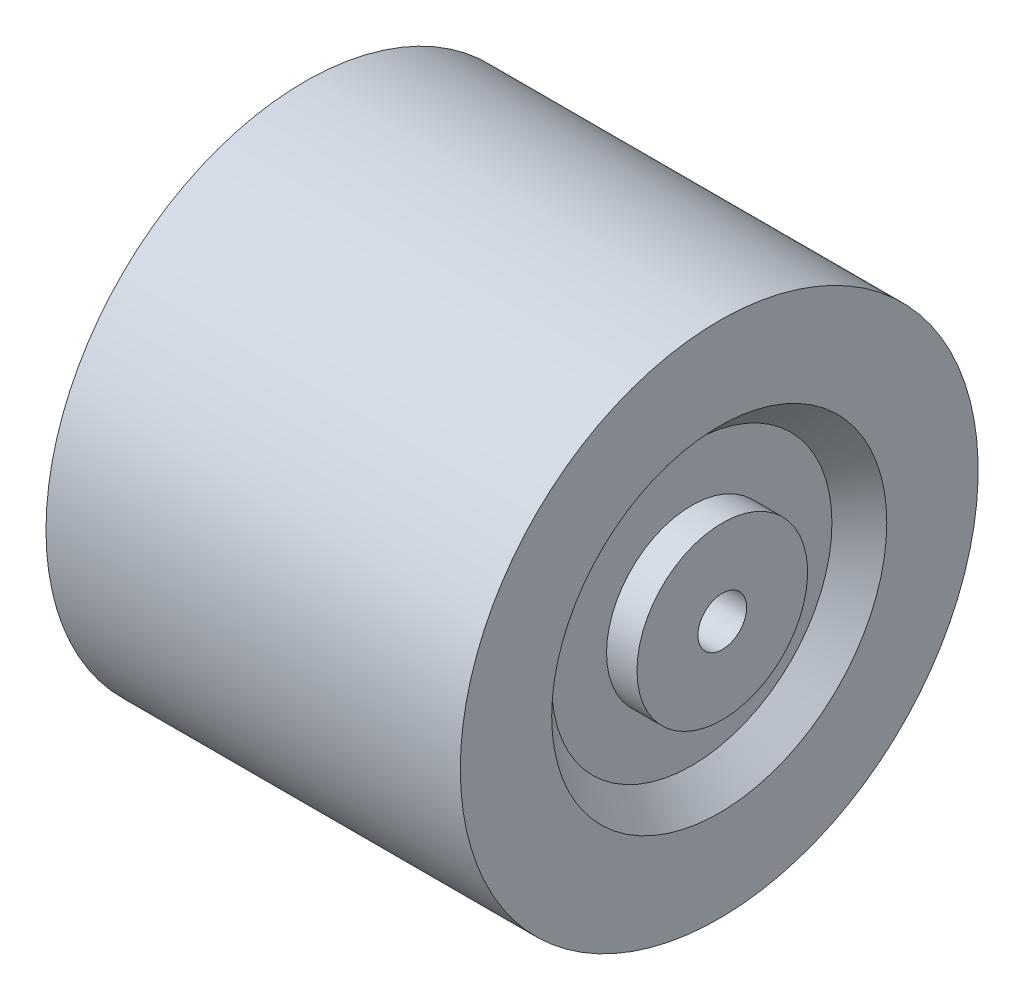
ISO-10303-21;
HEADER;
FILE_DESCRIPTION(('STEP AP214'),'2;1');
FILE_NAME('part.step','',(''),(''),'','','');
FILE_SCHEMA(('AUTOMOTIVE_DESIGN { 1 0 10303 214 1 1 1 1 }'));
ENDSEC;
DATA;
#1=APPLICATION_CONTEXT('core data for automotive mechanical design processes');
#2=APPLICATION_PROTOCOL_DEFINITION('international standard','automotive_design',2000,#1);
#3=PRODUCT_CONTEXT('',#1,'mechanical');
#4=PRODUCT('Part','Part','',(#3));
#5=PRODUCT_RELATED_PRODUCT_CATEGORY('part','',(#4));
#6=PRODUCT_DEFINITION_FORMATION('','',#4);
#7=PRODUCT_DEFINITION_CONTEXT('part definition',#1,'design');
#8=PRODUCT_DEFINITION('design','',#6,#7);
#9=PRODUCT_DEFINITION_SHAPE('','',#8);
#10=(LENGTH_UNIT() NAMED_UNIT(*) SI_UNIT(.MILLI.,.METRE.));
#11=(NAMED_UNIT(*) PLANE_ANGLE_UNIT() SI_UNIT($,.RADIAN.));
#12=(NAMED_UNIT(*) SI_UNIT($,.STERADIAN.) SOLID_ANGLE_UNIT());
#13=UNCERTAINTY_MEASURE_WITH_UNIT(LENGTH_MEASURE(1.E-05),#10,'distance_accuracy_value','');
#14=(GEOMETRIC_REPRESENTATION_CONTEXT(3) GLOBAL_UNCERTAINTY_ASSIGNED_CONTEXT((#13)) GLOBAL_UNIT_ASSIGNED_CONTEXT((#10,
#11,#12)) REPRESENTATION_CONTEXT('',''));
#15=CARTESIAN_POINT('',(0.,0.,0.));
#16=DIRECTION('',(0.,0.,1.));
#17=DIRECTION('',(1.,0.,0.));
#18=AXIS2_PLACEMENT_3D('',#15,#16,#17);
#19=CARTESIAN_POINT('',(0.,0.,0.));
#20=DIRECTION('',(-1.,0.,0.));
#21=DIRECTION('',(0.,0.,1.));
#22=AXIS2_PLACEMENT_3D('',#19,#20,#21);
#23=CYLINDRICAL_SURFACE('',#22,14.);
#24=CARTESIAN_POINT('',(29.5,0.,0.));
#25=DIRECTION('',(-1.,0.,0.));
#26=DIRECTION('',(0.,0.,1.));
#27=AXIS2_PLACEMENT_3D('',#24,#25,#26);
#28=CIRCLE('',#27,14.);
#29=CARTESIAN_POINT('',(29.5,0.,14.));
#30=VERTEX_POINT('',#29);
#31=EDGE_CURVE('E48',#30,#30,#28,.T.);
#32=ORIENTED_EDGE('',*,*,#31,.F.);
#33=EDGE_LOOP('',(#32));
#34=FACE_BOUND('',#33,.T.);
#35=CARTESIAN_POINT('',(34.5,0.,0.));
#36=DIRECTION('',(-1.,0.,0.));
#37=DIRECTION('',(0.,0.,1.));
#38=AXIS2_PLACEMENT_3D('',#35,#36,#37);
#39=CIRCLE('',#38,14.);
#40=CARTESIAN_POINT('',(34.5,0.,14.));
#41=VERTEX_POINT('',#40);
#42=EDGE_CURVE('E10',#41,#41,#39,.T.);
#43=ORIENTED_EDGE('',*,*,#42,.T.);
#44=EDGE_LOOP('',(#43));
#45=FACE_BOUND('',#44,.T.);
#46=ADVANCED_FACE('F26',(#34,#45),#23,.T.);
#47=CARTESIAN_POINT('',(34.5,4.,0.));
#48=DIRECTION('',(-1.,0.,0.));
#49=DIRECTION('',(0.,0.,1.));
#50=AXIS2_PLACEMENT_3D('',#47,#48,#49);
#51=PLANE('',#50);
#52=ORIENTED_EDGE('',*,*,#42,.F.);
#53=EDGE_LOOP('',(#52));
#54=FACE_BOUND('',#53,.T.);
#55=CARTESIAN_POINT('',(34.5,0.,0.));
#56=DIRECTION('',(-1.,0.,0.));
#57=DIRECTION('',(0.,0.,1.));
#58=AXIS2_PLACEMENT_3D('',#55,#56,#57);
#59=CIRCLE('',#58,4.);
#60=CARTESIAN_POINT('',(34.5,0.,4.));
#61=VERTEX_POINT('',#60);
#62=EDGE_CURVE('E32',#61,#61,#59,.T.);
#63=ORIENTED_EDGE('',*,*,#62,.T.);
#64=EDGE_LOOP('',(#63));
#65=FACE_BOUND('',#64,.T.);
#66=ADVANCED_FACE('F85',(#54,#65),#51,.F.);
#67=CARTESIAN_POINT('',(0.,0.,0.));
#68=DIRECTION('',(-1.,0.,0.));
#69=DIRECTION('',(0.,0.,1.));
#70=AXIS2_PLACEMENT_3D('',#67,#68,#69);
#71=CYLINDRICAL_SURFACE('',#70,4.);
#72=ORIENTED_EDGE('',*,*,#62,.F.);
#73=EDGE_LOOP('',(#72));
#74=FACE_BOUND('',#73,.T.);
#75=CARTESIAN_POINT('',(-34.5,0.,0.));
#76=DIRECTION('',(-1.,0.,0.));
#77=DIRECTION('',(0.,0.,1.));
#78=AXIS2_PLACEMENT_3D('',#75,#76,#77);
#79=CIRCLE('',#78,4.);
#80=CARTESIAN_POINT('',(-34.5,0.,4.));
#81=VERTEX_POINT('',#80);
#82=EDGE_CURVE('E54',#81,#81,#79,.T.);
#83=ORIENTED_EDGE('',*,*,#82,.T.);
#84=EDGE_LOOP('',(#83));
#85=FACE_BOUND('',#84,.T.);
#86=ADVANCED_FACE('F90',(#74,#85),#71,.F.);
#87=CARTESIAN_POINT('',(0.,0.,0.));
#88=DIRECTION('',(-1.,0.,0.));
#89=DIRECTION('',(0.,0.,1.));
#90=AXIS2_PLACEMENT_3D('',#87,#88,#89);
#91=CYLINDRICAL_SURFACE('',#90,42.5);
#92=CARTESIAN_POINT('',(34.,0.,0.));
#93=DIRECTION('',(-1.,0.,0.));
#94=DIRECTION('',(0.,0.,1.));
#95=AXIS2_PLACEMENT_3D('',#92,#93,#94);
#96=CIRCLE('',#95,42.5);
#97=CARTESIAN_POINT('',(34.,0.,42.5));
#98=VERTEX_POINT('',#97);
#99=EDGE_CURVE('E36',#98,#98,#96,.T.);
#100=ORIENTED_EDGE('',*,*,#99,.T.);
#101=EDGE_LOOP('',(#100));
#102=FACE_BOUND('',#101,.T.);
#103=CARTESIAN_POINT('',(-34.,0.,0.));
#104=DIRECTION('',(-1.,0.,0.));
#105=DIRECTION('',(0.,0.,1.));
#106=AXIS2_PLACEMENT_3D('',#103,#104,#105);
#107=CIRCLE('',#106,42.5);
#108=CARTESIAN_POINT('',(-34.,0.,42.5));
#109=VERTEX_POINT('',#108);
#110=EDGE_CURVE('E57',#109,#109,#107,.T.);
#111=ORIENTED_EDGE('',*,*,#110,.F.);
#112=EDGE_LOOP('',(#111));
#113=FACE_BOUND('',#112,.T.);
#114=ADVANCED_FACE('F113',(#102,#113),#91,.T.);
#115=CARTESIAN_POINT('',(34.,27.5,0.));
#116=DIRECTION('',(-1.,0.,0.));
#117=DIRECTION('',(0.,0.,1.));
#118=AXIS2_PLACEMENT_3D('',#115,#116,#117);
#119=PLANE('',#118);
#120=ORIENTED_EDGE('',*,*,#99,.F.);
#121=EDGE_LOOP('',(#120));
#122=FACE_BOUND('',#121,.T.);
#123=CARTESIAN_POINT('',(34.,0.,0.));
#124=DIRECTION('',(-1.,0.,0.));
#125=DIRECTION('',(0.,0.,1.));
#126=AXIS2_PLACEMENT_3D('',#123,#124,#125);
#127=CIRCLE('',#126,27.5);
#128=CARTESIAN_POINT('',(34.,0.,27.5));
#129=VERTEX_POINT('',#128);
#130=EDGE_CURVE('E40',#129,#129,#127,.T.);
#131=ORIENTED_EDGE('',*,*,#130,.T.);
#132=EDGE_LOOP('',(#131));
#133=FACE_BOUND('',#132,.T.);
#134=ADVANCED_FACE('F105',(#122,#133),#119,.F.);
#135=CARTESIAN_POINT('',(29.5,0.,0.));
#136=DIRECTION('',(1.,0.,0.));
#137=DIRECTION('',(0.,0.,-1.));
#138=AXIS2_PLACEMENT_3D('',#135,#136,#137);
#139=CONICAL_SURFACE('',#138,23.,0.785398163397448);
#140=ORIENTED_EDGE('',*,*,#130,.F.);
#141=EDGE_LOOP('',(#140));
#142=FACE_BOUND('',#141,.T.);
#143=CARTESIAN_POINT('',(29.5,0.,0.));
#144=DIRECTION('',(-1.,0.,0.));
#145=DIRECTION('',(0.,0.,1.));
#146=AXIS2_PLACEMENT_3D('',#143,#144,#145);
#147=CIRCLE('',#146,23.);
#148=CARTESIAN_POINT('',(29.5,0.,23.));
#149=VERTEX_POINT('',#148);
#150=EDGE_CURVE('E45',#149,#149,#147,.T.);
#151=ORIENTED_EDGE('',*,*,#150,.T.);
#152=EDGE_LOOP('',(#151));
#153=FACE_BOUND('',#152,.T.);
#154=ADVANCED_FACE('F96',(#142,#153),#139,.F.);
#155=CARTESIAN_POINT('',(29.5,14.,0.));
#156=DIRECTION('',(-1.,0.,0.));
#157=DIRECTION('',(0.,0.,1.));
#158=AXIS2_PLACEMENT_3D('',#155,#156,#157);
#159=PLANE('',#158);
#160=ORIENTED_EDGE('',*,*,#150,.F.);
#161=EDGE_LOOP('',(#160));
#162=FACE_BOUND('',#161,.T.);
#163=ORIENTED_EDGE('',*,*,#31,.T.);
#164=EDGE_LOOP('',(#163));
#165=FACE_BOUND('',#164,.T.);
#166=ADVANCED_FACE('F94',(#162,#165),#159,.F.);
#167=CARTESIAN_POINT('',(0.,0.,0.));
#168=DIRECTION('',(1.,0.,0.));
#169=DIRECTION('',(0.,0.,1.));
#170=AXIS2_PLACEMENT_3D('',#167,#168,#169);
#171=CYLINDRICAL_SURFACE('',#170,14.);
#172=CARTESIAN_POINT('',(-29.5,0.,0.));
#173=DIRECTION('',(-1.,0.,0.));
#174=DIRECTION('',(0.,0.,1.));
#175=AXIS2_PLACEMENT_3D('',#172,#173,#174);
#176=CIRCLE('',#175,14.);
#177=CARTESIAN_POINT('',(-29.5,0.,14.));
#178=VERTEX_POINT('',#177);
#179=EDGE_CURVE('E66',#178,#178,#176,.T.);
#180=ORIENTED_EDGE('',*,*,#179,.T.);
#181=EDGE_LOOP('',(#180));
#182=FACE_BOUND('',#181,.T.);
#183=CARTESIAN_POINT('',(-34.5,0.,0.));
#184=DIRECTION('',(-1.,0.,0.));
#185=DIRECTION('',(0.,0.,1.));
#186=AXIS2_PLACEMENT_3D('',#183,#184,#185);
#187=CIRCLE('',#186,14.);
#188=CARTESIAN_POINT('',(-34.5,0.,14.));
#189=VERTEX_POINT('',#188);
#190=EDGE_CURVE('E51',#189,#189,#187,.T.);
#191=ORIENTED_EDGE('',*,*,#190,.F.);
#192=EDGE_LOOP('',(#191));
#193=FACE_BOUND('',#192,.T.);
#194=ADVANCED_FACE('F70',(#182,#193),#171,.T.);
#195=CARTESIAN_POINT('',(-34.5,4.,0.));
#196=DIRECTION('',(1.,0.,0.));
#197=DIRECTION('',(0.,0.,1.));
#198=AXIS2_PLACEMENT_3D('',#195,#196,#197);
#199=PLANE('',#198);
#200=ORIENTED_EDGE('',*,*,#190,.T.);
#201=EDGE_LOOP('',(#200));
#202=FACE_BOUND('',#201,.T.);
#203=ORIENTED_EDGE('',*,*,#82,.F.);
#204=EDGE_LOOP('',(#203));
#205=FACE_BOUND('',#204,.T.);
#206=ADVANCED_FACE('F103',(#202,#205),#199,.F.);
#207=CARTESIAN_POINT('',(-34.,27.5,0.));
#208=DIRECTION('',(1.,0.,0.));
#209=DIRECTION('',(0.,0.,1.));
#210=AXIS2_PLACEMENT_3D('',#207,#208,#209);
#211=PLANE('',#210);
#212=ORIENTED_EDGE('',*,*,#110,.T.);
#213=EDGE_LOOP('',(#212));
#214=FACE_BOUND('',#213,.T.);
#215=CARTESIAN_POINT('',(-34.,0.,0.));
#216=DIRECTION('',(-1.,0.,0.));
#217=DIRECTION('',(0.,0.,1.));
#218=AXIS2_PLACEMENT_3D('',#215,#216,#217);
#219=CIRCLE('',#218,27.5);
#220=CARTESIAN_POINT('',(-34.,0.,27.5));
#221=VERTEX_POINT('',#220);
#222=EDGE_CURVE('E60',#221,#221,#219,.T.);
#223=ORIENTED_EDGE('',*,*,#222,.F.);
#224=EDGE_LOOP('',(#223));
#225=FACE_BOUND('',#224,.T.);
#226=ADVANCED_FACE('F81',(#214,#225),#211,.F.);
#227=CARTESIAN_POINT('',(-29.5,0.,0.));
#228=DIRECTION('',(-1.,0.,0.));
#229=DIRECTION('',(0.,0.,-1.));
#230=AXIS2_PLACEMENT_3D('',#227,#228,#229);
#231=CONICAL_SURFACE('',#230,23.,0.785398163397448);
#232=ORIENTED_EDGE('',*,*,#222,.T.);
#233=EDGE_LOOP('',(#232));
#234=FACE_BOUND('',#233,.T.);
#235=CARTESIAN_POINT('',(-29.5,0.,0.));
#236=DIRECTION('',(-1.,0.,0.));
#237=DIRECTION('',(0.,0.,1.));
#238=AXIS2_PLACEMENT_3D('',#235,#236,#237);
#239=CIRCLE('',#238,23.);
#240=CARTESIAN_POINT('',(-29.5,0.,23.));
#241=VERTEX_POINT('',#240);
#242=EDGE_CURVE('E63',#241,#241,#239,.T.);
#243=ORIENTED_EDGE('',*,*,#242,.F.);
#244=EDGE_LOOP('',(#243));
#245=FACE_BOUND('',#244,.T.);
#246=ADVANCED_FACE('F75',(#234,#245),#231,.F.);
#247=CARTESIAN_POINT('',(-29.5,14.,0.));
#248=DIRECTION('',(1.,0.,0.));
#249=DIRECTION('',(0.,0.,1.));
#250=AXIS2_PLACEMENT_3D('',#247,#248,#249);
#251=PLANE('',#250);
#252=ORIENTED_EDGE('',*,*,#242,.T.);
#253=EDGE_LOOP('',(#252));
#254=FACE_BOUND('',#253,.T.);
#255=ORIENTED_EDGE('',*,*,#179,.F.);
#256=EDGE_LOOP('',(#255));
#257=FACE_BOUND('',#256,.T.);
#258=ADVANCED_FACE('F73',(#254,#257),#251,.F.);
#259=CLOSED_SHELL('',(#46,#66,#86,#114,#134,#154,#166,#194,#206,#226,#246,#258));
#260=MANIFOLD_SOLID_BREP('B2',#259);
#261=ADVANCED_BREP_SHAPE_REPRESENTATION('',(#18,#260),#14);
#262=SHAPE_DEFINITION_REPRESENTATION(#9,#261);
ENDSEC;
END-ISO-10303-21;
